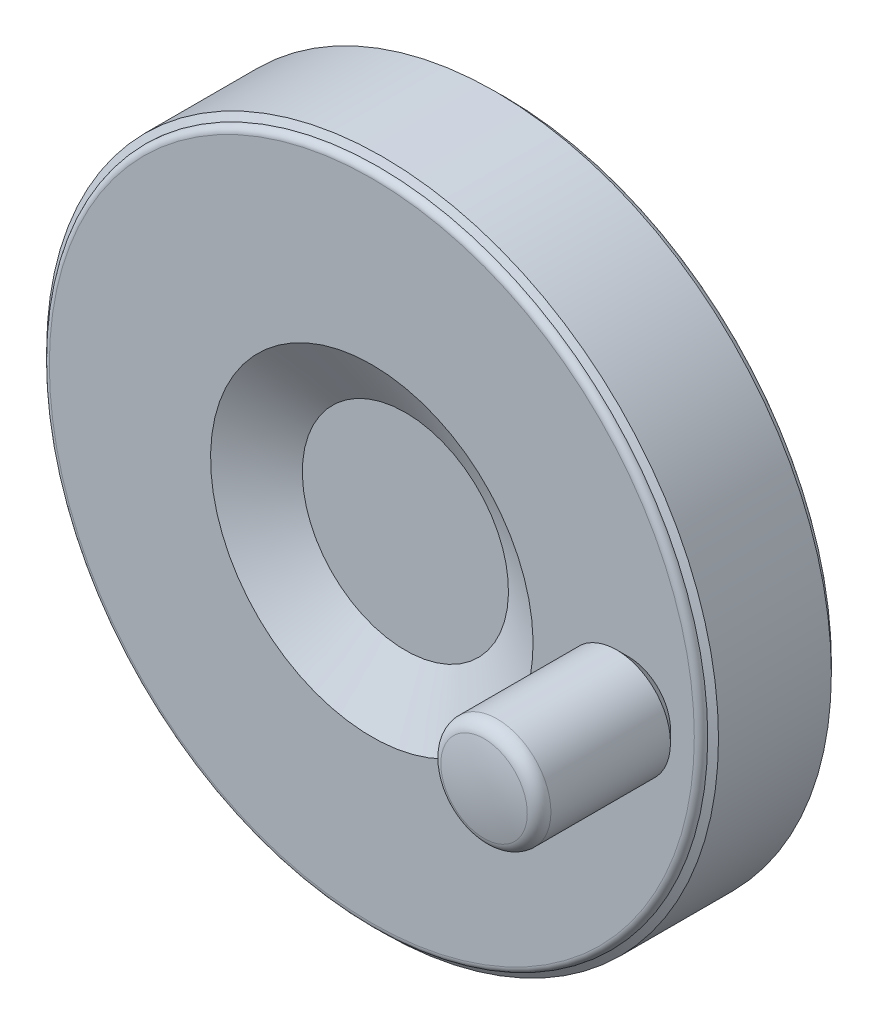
ISO-10303-21;
HEADER;
FILE_DESCRIPTION(('STEP AP214'),'2;1');
FILE_NAME('part.step','',(''),(''),'','','');
FILE_SCHEMA(('AUTOMOTIVE_DESIGN { 1 0 10303 214 1 1 1 1 }'));
ENDSEC;
DATA;
#1=APPLICATION_CONTEXT('core data for automotive mechanical design processes');
#2=APPLICATION_PROTOCOL_DEFINITION('international standard','automotive_design',2000,#1);
#3=PRODUCT_CONTEXT('',#1,'mechanical');
#4=PRODUCT('Part','Part','',(#3));
#5=PRODUCT_RELATED_PRODUCT_CATEGORY('part','',(#4));
#6=PRODUCT_DEFINITION_FORMATION('','',#4);
#7=PRODUCT_DEFINITION_CONTEXT('part definition',#1,'design');
#8=PRODUCT_DEFINITION('design','',#6,#7);
#9=PRODUCT_DEFINITION_SHAPE('','',#8);
#10=(LENGTH_UNIT() NAMED_UNIT(*) SI_UNIT(.MILLI.,.METRE.));
#11=(NAMED_UNIT(*) PLANE_ANGLE_UNIT() SI_UNIT($,.RADIAN.));
#12=(NAMED_UNIT(*) SI_UNIT($,.STERADIAN.) SOLID_ANGLE_UNIT());
#13=UNCERTAINTY_MEASURE_WITH_UNIT(LENGTH_MEASURE(1.E-05),#10,'distance_accuracy_value','');
#14=(GEOMETRIC_REPRESENTATION_CONTEXT(3) GLOBAL_UNCERTAINTY_ASSIGNED_CONTEXT((#13)) GLOBAL_UNIT_ASSIGNED_CONTEXT((#10,
#11,#12)) REPRESENTATION_CONTEXT('',''));
#15=CARTESIAN_POINT('',(0.,0.,0.));
#16=DIRECTION('',(0.,0.,1.));
#17=DIRECTION('',(1.,0.,0.));
#18=AXIS2_PLACEMENT_3D('',#15,#16,#17);
#19=CARTESIAN_POINT('',(-17.5,0.,7.44337567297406));
#20=DIRECTION('',(0.,0.5,0.866025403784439));
#21=DIRECTION('',(0.,0.866025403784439,-0.5));
#22=AXIS2_PLACEMENT_3D('',#19,#20,#21);
#23=PLANE('',#22);
#24=DIRECTION('',(-1.,0.,0.));
#25=VECTOR('',#24,1.);
#26=CARTESIAN_POINT('',(-17.5,0.,7.44337567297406));
#27=LINE('',#26,#25);
#28=CARTESIAN_POINT('',(-13.3333333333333,0.,7.44337567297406));
#29=VERTEX_POINT('',#28);
#30=CARTESIAN_POINT('',(-17.5,0.,7.44337567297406));
#31=VERTEX_POINT('',#30);
#32=EDGE_CURVE('E97',#29,#31,#27,.T.);
#33=ORIENTED_EDGE('',*,*,#32,.T.);
#34=DIRECTION('',(0.,0.866025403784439,-0.5));
#35=VECTOR('',#34,1.);
#36=CARTESIAN_POINT('',(-17.5,0.,7.44337567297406));
#37=LINE('',#36,#35);
#38=CARTESIAN_POINT('',(-17.5,1.25,6.72168783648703));
#39=VERTEX_POINT('',#38);
#40=EDGE_CURVE('E86',#39,#31,#37,.F.);
#41=ORIENTED_EDGE('',*,*,#40,.F.);
#42=DIRECTION('',(-1.,0.,0.));
#43=VECTOR('',#42,1.);
#44=CARTESIAN_POINT('',(-17.5,1.25,6.72168783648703));
#45=LINE('',#44,#43);
#46=CARTESIAN_POINT('',(-13.3333333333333,1.25,6.72168783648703));
#47=VERTEX_POINT('',#46);
#48=EDGE_CURVE('E299',#39,#47,#45,.F.);
#49=ORIENTED_EDGE('',*,*,#48,.T.);
#50=DIRECTION('',(0.,0.866025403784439,-0.5));
#51=VECTOR('',#50,1.);
#52=CARTESIAN_POINT('',(-13.3333333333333,0.,7.44337567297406));
#53=LINE('',#52,#51);
#54=EDGE_CURVE('E81',#29,#47,#53,.T.);
#55=ORIENTED_EDGE('',*,*,#54,.F.);
#56=EDGE_LOOP('',(#33,#41,#49,#55));
#57=FACE_BOUND('',#56,.T.);
#58=ADVANCED_FACE('F14',(#57),#23,.F.);
#59=CARTESIAN_POINT('',(-17.5,-1.25,6.72168783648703));
#60=DIRECTION('',(0.,-0.5,0.866025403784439));
#61=DIRECTION('',(0.,0.866025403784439,0.5));
#62=AXIS2_PLACEMENT_3D('',#59,#60,#61);
#63=PLANE('',#62);
#64=DIRECTION('',(1.,0.,0.));
#65=VECTOR('',#64,1.);
#66=CARTESIAN_POINT('',(-17.5,-1.25,6.72168783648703));
#67=LINE('',#66,#65);
#68=CARTESIAN_POINT('',(-13.3333333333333,-1.25,6.72168783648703));
#69=VERTEX_POINT('',#68);
#70=CARTESIAN_POINT('',(-17.5,-1.25,6.72168783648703));
#71=VERTEX_POINT('',#70);
#72=EDGE_CURVE('E102',#69,#71,#67,.F.);
#73=ORIENTED_EDGE('',*,*,#72,.T.);
#74=DIRECTION('',(0.,0.866025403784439,0.5));
#75=VECTOR('',#74,1.);
#76=CARTESIAN_POINT('',(-17.5,-1.25,6.72168783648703));
#77=LINE('',#76,#75);
#78=EDGE_CURVE('E89',#31,#71,#77,.F.);
#79=ORIENTED_EDGE('',*,*,#78,.F.);
#80=ORIENTED_EDGE('',*,*,#32,.F.);
#81=DIRECTION('',(0.,0.866025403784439,0.5));
#82=VECTOR('',#81,1.);
#83=CARTESIAN_POINT('',(-13.3333333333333,-1.25,6.72168783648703));
#84=LINE('',#83,#82);
#85=EDGE_CURVE('E104',#69,#29,#84,.T.);
#86=ORIENTED_EDGE('',*,*,#85,.F.);
#87=EDGE_LOOP('',(#73,#79,#80,#86));
#88=FACE_BOUND('',#87,.T.);
#89=ADVANCED_FACE('F100',(#88),#63,.F.);
#90=CARTESIAN_POINT('',(-17.5,1.25,6.72168783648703));
#91=DIRECTION('',(0.,1.,0.));
#92=DIRECTION('',(-1.,0.,0.));
#93=AXIS2_PLACEMENT_3D('',#90,#91,#92);
#94=PLANE('',#93);
#95=ORIENTED_EDGE('',*,*,#48,.F.);
#96=DIRECTION('',(0.,0.,1.));
#97=VECTOR('',#96,1.);
#98=CARTESIAN_POINT('',(-17.5,1.25,6.72168783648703));
#99=LINE('',#98,#97);
#100=CARTESIAN_POINT('',(-17.5,1.25,5.27831216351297));
#101=VERTEX_POINT('',#100);
#102=EDGE_CURVE('E92',#101,#39,#99,.T.);
#103=ORIENTED_EDGE('',*,*,#102,.F.);
#104=DIRECTION('',(-1.,0.,0.));
#105=VECTOR('',#104,1.);
#106=CARTESIAN_POINT('',(-17.5,1.25,5.27831216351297));
#107=LINE('',#106,#105);
#108=CARTESIAN_POINT('',(-13.3333333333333,1.25,5.27831216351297));
#109=VERTEX_POINT('',#108);
#110=EDGE_CURVE('E289',#101,#109,#107,.F.);
#111=ORIENTED_EDGE('',*,*,#110,.T.);
#112=DIRECTION('',(0.,0.,1.));
#113=VECTOR('',#112,1.);
#114=CARTESIAN_POINT('',(-13.3333333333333,1.25,6.72168783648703));
#115=LINE('',#114,#113);
#116=EDGE_CURVE('E297',#47,#109,#115,.F.);
#117=ORIENTED_EDGE('',*,*,#116,.F.);
#118=EDGE_LOOP('',(#95,#103,#111,#117));
#119=FACE_BOUND('',#118,.T.);
#120=ADVANCED_FACE('F302',(#119),#94,.F.);
#121=CARTESIAN_POINT('',(-17.5,-1.25,5.27831216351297));
#122=DIRECTION('',(0.,-1.,0.));
#123=DIRECTION('',(1.,0.,0.));
#124=AXIS2_PLACEMENT_3D('',#121,#122,#123);
#125=PLANE('',#124);
#126=DIRECTION('',(-1.,0.,0.));
#127=VECTOR('',#126,1.);
#128=CARTESIAN_POINT('',(-17.5,-1.25,5.27831216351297));
#129=LINE('',#128,#127);
#130=CARTESIAN_POINT('',(-13.3333333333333,-1.25,5.27831216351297));
#131=VERTEX_POINT('',#130);
#132=CARTESIAN_POINT('',(-17.5,-1.25,5.27831216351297));
#133=VERTEX_POINT('',#132);
#134=EDGE_CURVE('E280',#131,#133,#129,.T.);
#135=ORIENTED_EDGE('',*,*,#134,.T.);
#136=DIRECTION('',(0.,0.,1.));
#137=VECTOR('',#136,1.);
#138=CARTESIAN_POINT('',(-17.5,-1.25,5.27831216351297));
#139=LINE('',#138,#137);
#140=EDGE_CURVE('E294',#71,#133,#139,.F.);
#141=ORIENTED_EDGE('',*,*,#140,.F.);
#142=ORIENTED_EDGE('',*,*,#72,.F.);
#143=DIRECTION('',(0.,0.,1.));
#144=VECTOR('',#143,1.);
#145=CARTESIAN_POINT('',(-13.3333333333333,-1.25,0.));
#146=LINE('',#145,#144);
#147=EDGE_CURVE('E283',#131,#69,#146,.T.);
#148=ORIENTED_EDGE('',*,*,#147,.F.);
#149=EDGE_LOOP('',(#135,#141,#142,#148));
#150=FACE_BOUND('',#149,.T.);
#151=ADVANCED_FACE('F309',(#150),#125,.F.);
#152=CARTESIAN_POINT('',(-17.5,1.25,5.27831216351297));
#153=DIRECTION('',(0.,0.5,-0.866025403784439));
#154=DIRECTION('',(0.,-0.866025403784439,-0.5));
#155=AXIS2_PLACEMENT_3D('',#152,#153,#154);
#156=PLANE('',#155);
#157=ORIENTED_EDGE('',*,*,#110,.F.);
#158=DIRECTION('',(0.,-0.866025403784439,-0.5));
#159=VECTOR('',#158,1.);
#160=CARTESIAN_POINT('',(-17.5,1.25,5.27831216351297));
#161=LINE('',#160,#159);
#162=CARTESIAN_POINT('',(-17.5,0.,4.55662432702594));
#163=VERTEX_POINT('',#162);
#164=EDGE_CURVE('E292',#163,#101,#161,.F.);
#165=ORIENTED_EDGE('',*,*,#164,.F.);
#166=DIRECTION('',(-1.,0.,0.));
#167=VECTOR('',#166,1.);
#168=CARTESIAN_POINT('',(-17.5,0.,4.55662432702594));
#169=LINE('',#168,#167);
#170=CARTESIAN_POINT('',(-13.3333333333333,0.,4.55662432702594));
#171=VERTEX_POINT('',#170);
#172=EDGE_CURVE('E278',#163,#171,#169,.F.);
#173=ORIENTED_EDGE('',*,*,#172,.T.);
#174=DIRECTION('',(0.,-0.866025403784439,-0.5));
#175=VECTOR('',#174,1.);
#176=CARTESIAN_POINT('',(-13.3333333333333,1.25,5.27831216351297));
#177=LINE('',#176,#175);
#178=EDGE_CURVE('E286',#109,#171,#177,.T.);
#179=ORIENTED_EDGE('',*,*,#178,.F.);
#180=EDGE_LOOP('',(#157,#165,#173,#179));
#181=FACE_BOUND('',#180,.T.);
#182=ADVANCED_FACE('F316',(#181),#156,.F.);
#183=CARTESIAN_POINT('',(-13.3333333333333,0.,0.));
#184=DIRECTION('',(-1.,0.,0.));
#185=DIRECTION('',(0.,-1.,0.));
#186=AXIS2_PLACEMENT_3D('',#183,#184,#185);
#187=PLANE('',#186);
#188=ORIENTED_EDGE('',*,*,#54,.T.);
#189=ORIENTED_EDGE('',*,*,#116,.T.);
#190=ORIENTED_EDGE('',*,*,#178,.T.);
#191=DIRECTION('',(0.,-0.866025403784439,0.5));
#192=VECTOR('',#191,1.);
#193=CARTESIAN_POINT('',(-13.3333333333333,0.,4.55662432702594));
#194=LINE('',#193,#192);
#195=EDGE_CURVE('E275',#171,#131,#194,.T.);
#196=ORIENTED_EDGE('',*,*,#195,.T.);
#197=ORIENTED_EDGE('',*,*,#147,.T.);
#198=ORIENTED_EDGE('',*,*,#85,.T.);
#199=EDGE_LOOP('',(#188,#189,#190,#196,#197,#198));
#200=FACE_BOUND('',#199,.T.);
#201=ADVANCED_FACE('F306',(#200),#187,.T.);
#202=CARTESIAN_POINT('',(-17.5,0.,4.55662432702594));
#203=DIRECTION('',(0.,-0.5,-0.866025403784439));
#204=DIRECTION('',(0.,-0.866025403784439,0.5));
#205=AXIS2_PLACEMENT_3D('',#202,#203,#204);
#206=PLANE('',#205);
#207=ORIENTED_EDGE('',*,*,#172,.F.);
#208=DIRECTION('',(0.,0.866025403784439,-0.5));
#209=VECTOR('',#208,1.);
#210=CARTESIAN_POINT('',(-17.5,-1.25,5.27831216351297));
#211=LINE('',#210,#209);
#212=EDGE_CURVE('E271',#133,#163,#211,.T.);
#213=ORIENTED_EDGE('',*,*,#212,.F.);
#214=ORIENTED_EDGE('',*,*,#134,.F.);
#215=ORIENTED_EDGE('',*,*,#195,.F.);
#216=EDGE_LOOP('',(#207,#213,#214,#215));
#217=FACE_BOUND('',#216,.T.);
#218=ADVANCED_FACE('F314',(#217),#206,.F.);
#219=CARTESIAN_POINT('',(-17.5,0.,7.00475));
#220=DIRECTION('',(-1.,0.,0.));
#221=DIRECTION('',(0.,-1.,0.));
#222=AXIS2_PLACEMENT_3D('',#219,#220,#221);
#223=PLANE('',#222);
#224=CARTESIAN_POINT('',(-17.4999999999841,0.,6.));
#225=DIRECTION('',(1.,0.,0.));
#226=DIRECTION('',(0.,1.,0.));
#227=AXIS2_PLACEMENT_3D('',#224,#225,#226);
#228=CIRCLE('',#227,2.00950000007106);
#229=CARTESIAN_POINT('',(-17.4999999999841,2.00950000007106,6.));
#230=VERTEX_POINT('',#229);
#231=EDGE_CURVE('E274',#230,#230,#228,.T.);
#232=ORIENTED_EDGE('',*,*,#231,.F.);
#233=EDGE_LOOP('',(#232));
#234=FACE_BOUND('',#233,.T.);
#235=ORIENTED_EDGE('',*,*,#140,.T.);
#236=ORIENTED_EDGE('',*,*,#212,.T.);
#237=ORIENTED_EDGE('',*,*,#164,.T.);
#238=ORIENTED_EDGE('',*,*,#102,.T.);
#239=ORIENTED_EDGE('',*,*,#40,.T.);
#240=ORIENTED_EDGE('',*,*,#78,.T.);
#241=EDGE_LOOP('',(#235,#236,#237,#238,#239,#240));
#242=FACE_BOUND('',#241,.T.);
#243=ADVANCED_FACE('F87',(#234,#242),#223,.T.);
#244=CARTESIAN_POINT('',(0.,0.,11.5));
#245=DIRECTION('',(0.,0.,-1.));
#246=DIRECTION('',(-1.,0.,0.));
#247=AXIS2_PLACEMENT_3D('',#244,#245,#246);
#248=CYLINDRICAL_SURFACE('',#247,5.);
#249=CARTESIAN_POINT('',(0.,0.,22.));
#250=DIRECTION('',(0.,0.,-1.));
#251=DIRECTION('',(0.,-1.,0.));
#252=AXIS2_PLACEMENT_3D('',#249,#250,#251);
#253=CIRCLE('',#252,5.);
#254=CARTESIAN_POINT('',(0.,-5.,22.));
#255=VERTEX_POINT('',#254);
#256=EDGE_CURVE('E94',#255,#255,#253,.T.);
#257=ORIENTED_EDGE('',*,*,#256,.F.);
#258=EDGE_LOOP('',(#257));
#259=FACE_BOUND('',#258,.T.);
#260=CARTESIAN_POINT('',(0.,0.,0.));
#261=DIRECTION('',(0.,0.,-1.));
#262=DIRECTION('',(-1.,0.,0.));
#263=AXIS2_PLACEMENT_3D('',#260,#261,#262);
#264=CIRCLE('',#263,5.);
#265=CARTESIAN_POINT('',(-5.,0.,0.));
#266=VERTEX_POINT('',#265);
#267=EDGE_CURVE('E270',#266,#266,#264,.F.);
#268=ORIENTED_EDGE('',*,*,#267,.F.);
#269=EDGE_LOOP('',(#268));
#270=FACE_BOUND('',#269,.T.);
#271=ADVANCED_FACE('F383',(#259,#270),#248,.F.);
#272=CARTESIAN_POINT('',(-17.0095000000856,0.,6.));
#273=DIRECTION('',(1.,0.,0.));
#274=DIRECTION('',(0.,1.,0.));
#275=AXIS2_PLACEMENT_3D('',#272,#273,#274);
#276=CONICAL_SURFACE('',#275,2.49999999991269,0.785398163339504);
#277=CARTESIAN_POINT('',(-17.0095,0.,6.));
#278=DIRECTION('',(-1.,0.,0.));
#279=DIRECTION('',(0.,-1.,0.));
#280=AXIS2_PLACEMENT_3D('',#277,#278,#279);
#281=CIRCLE('',#280,2.5);
#282=CARTESIAN_POINT('',(-17.0095,-2.5,6.));
#283=VERTEX_POINT('',#282);
#284=EDGE_CURVE('E267',#283,#283,#281,.F.);
#285=ORIENTED_EDGE('',*,*,#284,.F.);
#286=EDGE_LOOP('',(#285));
#287=FACE_BOUND('',#286,.T.);
#288=ORIENTED_EDGE('',*,*,#231,.T.);
#289=EDGE_LOOP('',(#288));
#290=FACE_BOUND('',#289,.T.);
#291=ADVANCED_FACE('F393',(#287,#290),#276,.T.);
#292=CARTESIAN_POINT('',(-6.5,0.,0.));
#293=DIRECTION('',(0.,0.,-1.));
#294=DIRECTION('',(-1.,0.,0.));
#295=AXIS2_PLACEMENT_3D('',#292,#293,#294);
#296=PLANE('',#295);
#297=ORIENTED_EDGE('',*,*,#267,.T.);
#298=EDGE_LOOP('',(#297));
#299=FACE_BOUND('',#298,.T.);
#300=CARTESIAN_POINT('',(0.,0.,0.));
#301=DIRECTION('',(0.,0.,-1.));
#302=DIRECTION('',(-1.,0.,0.));
#303=AXIS2_PLACEMENT_3D('',#300,#301,#302);
#304=CIRCLE('',#303,8.);
#305=CARTESIAN_POINT('',(-8.,0.,0.));
#306=VERTEX_POINT('',#305);
#307=EDGE_CURVE('E266',#306,#306,#304,.F.);
#308=ORIENTED_EDGE('',*,*,#307,.F.);
#309=EDGE_LOOP('',(#308));
#310=FACE_BOUND('',#309,.T.);
#311=ADVANCED_FACE('F403',(#299,#310),#296,.T.);
#312=CARTESIAN_POINT('',(-11.25,0.,6.));
#313=DIRECTION('',(-1.,0.,0.));
#314=DIRECTION('',(0.,-1.,0.));
#315=AXIS2_PLACEMENT_3D('',#312,#313,#314);
#316=CYLINDRICAL_SURFACE('',#315,2.5);
#317=CARTESIAN_POINT('',(-7.99999999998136,0.,6.));
#318=DIRECTION('',(-1.,0.,0.));
#319=DIRECTION('',(0.,0.,1.));
#320=AXIS2_PLACEMENT_3D('',#317,#318,#319);
#321=CIRCLE('',#320,2.49999999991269);
#322=CARTESIAN_POINT('',(-7.99999999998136,0.,8.49999999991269));
#323=VERTEX_POINT('',#322);
#324=EDGE_CURVE('E263',#323,#323,#321,.T.);
#325=ORIENTED_EDGE('',*,*,#324,.T.);
#326=EDGE_LOOP('',(#325));
#327=FACE_BOUND('',#326,.T.);
#328=ORIENTED_EDGE('',*,*,#284,.T.);
#329=EDGE_LOOP('',(#328));
#330=FACE_BOUND('',#329,.T.);
#331=ADVANCED_FACE('F413',(#327,#330),#316,.T.);
#332=CARTESIAN_POINT('',(0.,0.,0.15));
#333=DIRECTION('',(0.,0.,-1.));
#334=DIRECTION('',(-1.,0.,0.));
#335=AXIS2_PLACEMENT_3D('',#332,#333,#334);
#336=CYLINDRICAL_SURFACE('',#335,8.);
#337=CARTESIAN_POINT('',(0.,0.,0.3));
#338=DIRECTION('',(0.,0.,-1.));
#339=DIRECTION('',(-1.,0.,0.));
#340=AXIS2_PLACEMENT_3D('',#337,#338,#339);
#341=CIRCLE('',#340,8.);
#342=CARTESIAN_POINT('',(-8.,0.,0.3));
#343=VERTEX_POINT('',#342);
#344=EDGE_CURVE('E262',#343,#343,#341,.F.);
#345=ORIENTED_EDGE('',*,*,#344,.F.);
#346=EDGE_LOOP('',(#345));
#347=FACE_BOUND('',#346,.T.);
#348=ORIENTED_EDGE('',*,*,#307,.T.);
#349=EDGE_LOOP('',(#348));
#350=FACE_BOUND('',#349,.T.);
#351=ADVANCED_FACE('F423',(#347,#350),#336,.T.);
#352=CARTESIAN_POINT('',(-8.27777777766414,0.,6.));
#353=DIRECTION('',(-1.,0.,0.));
#354=DIRECTION('',(0.,-1.,0.));
#355=AXIS2_PLACEMENT_3D('',#352,#353,#354);
#356=CONICAL_SURFACE('',#355,2.77777777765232,0.785398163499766);
#357=CARTESIAN_POINT('',(-8.27777777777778,0.,6.));
#358=DIRECTION('',(-1.,0.,0.));
#359=DIRECTION('',(0.,-1.,0.));
#360=AXIS2_PLACEMENT_3D('',#357,#358,#359);
#361=CIRCLE('',#360,2.77777777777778);
#362=CARTESIAN_POINT('',(-8.27777777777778,-2.77777777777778,6.));
#363=VERTEX_POINT('',#362);
#364=EDGE_CURVE('E259',#363,#363,#361,.T.);
#365=ORIENTED_EDGE('',*,*,#364,.T.);
#366=EDGE_LOOP('',(#365));
#367=FACE_BOUND('',#366,.T.);
#368=ORIENTED_EDGE('',*,*,#324,.F.);
#369=EDGE_LOOP('',(#368));
#370=FACE_BOUND('',#369,.T.);
#371=ADVANCED_FACE('F433',(#367,#370),#356,.F.);
#372=CARTESIAN_POINT('',(-12.,0.,0.3));
#373=DIRECTION('',(0.,0.,-1.));
#374=DIRECTION('',(-1.,0.,0.));
#375=AXIS2_PLACEMENT_3D('',#372,#373,#374);
#376=PLANE('',#375);
#377=ORIENTED_EDGE('',*,*,#344,.T.);
#378=EDGE_LOOP('',(#377));
#379=FACE_BOUND('',#378,.T.);
#380=CARTESIAN_POINT('',(0.,0.,0.3));
#381=DIRECTION('',(0.,0.,1.));
#382=DIRECTION('',(1.,0.,0.));
#383=AXIS2_PLACEMENT_3D('',#380,#381,#382);
#384=CIRCLE('',#383,16.);
#385=CARTESIAN_POINT('',(16.,0.,0.3));
#386=VERTEX_POINT('',#385);
#387=EDGE_CURVE('E155',#386,#386,#384,.T.);
#388=ORIENTED_EDGE('',*,*,#387,.F.);
#389=EDGE_LOOP('',(#388));
#390=FACE_BOUND('',#389,.T.);
#391=ADVANCED_FACE('F175',(#379,#390),#376,.T.);
#392=CARTESIAN_POINT('',(-12.8888888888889,0.,6.));
#393=DIRECTION('',(-1.,0.,0.));
#394=DIRECTION('',(0.,-1.,0.));
#395=AXIS2_PLACEMENT_3D('',#392,#393,#394);
#396=CYLINDRICAL_SURFACE('',#395,2.77777777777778);
#397=CARTESIAN_POINT('',(-17.5,0.,3.22222222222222));
#398=CARTESIAN_POINT('',(-17.4999972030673,0.15483515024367,3.22222928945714));
#399=CARTESIAN_POINT('',(-17.4979218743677,0.309868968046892,3.23522278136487));
#400=CARTESIAN_POINT('',(-17.4898374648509,0.61571019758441,3.2868669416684));
#401=CARTESIAN_POINT('',(-17.4838203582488,0.766508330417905,3.32556995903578));
#402=CARTESIAN_POINT('',(-17.4685279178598,1.05923809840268,3.42744542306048));
#403=CARTESIAN_POINT('',(-17.4592565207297,1.2011802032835,3.49058831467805));
#404=CARTESIAN_POINT('',(-17.4384797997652,1.47239412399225,3.63948377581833));
#405=CARTESIAN_POINT('',(-17.4269753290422,1.6016707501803,3.72522771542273));
#406=CARTESIAN_POINT('',(-17.4028946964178,1.84508936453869,3.91770404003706));
#407=CARTESIAN_POINT('',(-17.3903107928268,1.95910384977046,4.02459673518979));
#408=CARTESIAN_POINT('',(-17.3655490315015,2.16766339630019,4.2559961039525));
#409=CARTESIAN_POINT('',(-17.3533712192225,2.26220628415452,4.38050474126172));
#410=CARTESIAN_POINT('',(-17.3307273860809,2.42962752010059,4.64445008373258));
#411=CARTESIAN_POINT('',(-17.3202712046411,2.5023831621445,4.78396553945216));
#412=CARTESIAN_POINT('',(-17.3023595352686,2.62337928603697,5.07342930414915));
#413=CARTESIAN_POINT('',(-17.2949038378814,2.67162147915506,5.22337688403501));
#414=CARTESIAN_POINT('',(-17.2839127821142,2.74182853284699,5.52812072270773));
#415=CARTESIAN_POINT('',(-17.2803451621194,2.76400975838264,5.68286594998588));
#416=CARTESIAN_POINT('',(-17.2774364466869,2.78213578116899,5.99392021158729));
#417=CARTESIAN_POINT('',(-17.2780950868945,2.77808221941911,6.15022914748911));
#418=CARTESIAN_POINT('',(-17.2835349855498,2.74403032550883,6.45843547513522));
#419=CARTESIAN_POINT('',(-17.2882777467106,2.71427425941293,6.61036041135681));
#420=CARTESIAN_POINT('',(-17.3012913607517,2.63004131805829,6.90703490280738));
#421=CARTESIAN_POINT('',(-17.3095623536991,2.57556346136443,7.05178417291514));
#422=CARTESIAN_POINT('',(-17.3287428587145,2.44318258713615,7.33073258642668));
#423=CARTESIAN_POINT('',(-17.3396638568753,2.36517722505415,7.46488233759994));
#424=CARTESIAN_POINT('',(-17.3629046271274,2.18803489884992,7.71826969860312));
#425=CARTESIAN_POINT('',(-17.3752243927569,2.0888980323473,7.83750737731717));
#426=CARTESIAN_POINT('',(-17.4000426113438,1.8710016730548,8.05908020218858));
#427=CARTESIAN_POINT('',(-17.4125415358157,1.75203769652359,8.16121428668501));
#428=CARTESIAN_POINT('',(-17.4361897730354,1.49848935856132,8.34414600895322));
#429=CARTESIAN_POINT('',(-17.447338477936,1.36389801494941,8.42493405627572));
#430=CARTESIAN_POINT('',(-17.4670449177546,1.08269801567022,8.56288766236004));
#431=CARTESIAN_POINT('',(-17.4755986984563,0.936071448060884,8.62001721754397));
#432=CARTESIAN_POINT('',(-17.4891076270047,0.635333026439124,8.70866796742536));
#433=CARTESIAN_POINT('',(-17.4940703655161,0.481237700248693,8.74024319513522));
#434=CARTESIAN_POINT('',(-17.4979751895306,0.271699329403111,8.76499642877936));
#435=CARTESIAN_POINT('',(-17.4987328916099,0.21747979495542,8.76978562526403));
#436=CARTESIAN_POINT('',(-17.4997457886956,0.108848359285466,8.776177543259));
#437=CARTESIAN_POINT('',(-17.5000009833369,0.0544364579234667,8.77778026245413));
#438=CARTESIAN_POINT('',(-17.4999972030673,-0.154835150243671,8.77777071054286));
#439=CARTESIAN_POINT('',(-17.4979218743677,-0.309868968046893,8.76477721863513));
#440=CARTESIAN_POINT('',(-17.4898374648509,-0.615710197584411,8.7131330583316));
#441=CARTESIAN_POINT('',(-17.4838203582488,-0.766508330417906,8.67443004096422));
#442=CARTESIAN_POINT('',(-17.4685279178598,-1.05923809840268,8.57255457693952));
#443=CARTESIAN_POINT('',(-17.4592565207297,-1.20118020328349,8.50941168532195));
#444=CARTESIAN_POINT('',(-17.4384797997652,-1.47239412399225,8.36051622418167));
#445=CARTESIAN_POINT('',(-17.4269753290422,-1.6016707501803,8.27477228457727));
#446=CARTESIAN_POINT('',(-17.4028946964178,-1.84508936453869,8.08229595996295));
#447=CARTESIAN_POINT('',(-17.3903107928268,-1.95910384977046,7.97540326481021));
#448=CARTESIAN_POINT('',(-17.3655490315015,-2.16766339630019,7.7440038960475));
#449=CARTESIAN_POINT('',(-17.3533712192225,-2.26220628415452,7.61949525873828));
#450=CARTESIAN_POINT('',(-17.3307273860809,-2.42962752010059,7.35554991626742));
#451=CARTESIAN_POINT('',(-17.3202712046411,-2.5023831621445,7.21603446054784));
#452=CARTESIAN_POINT('',(-17.3023595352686,-2.62337928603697,6.92657069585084));
#453=CARTESIAN_POINT('',(-17.2949038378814,-2.67162147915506,6.77662311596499));
#454=CARTESIAN_POINT('',(-17.2839127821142,-2.74182853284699,6.47187927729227));
#455=CARTESIAN_POINT('',(-17.2803451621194,-2.76400975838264,6.31713405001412));
#456=CARTESIAN_POINT('',(-17.2774364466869,-2.78213578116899,6.00607978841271));
#457=CARTESIAN_POINT('',(-17.2780950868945,-2.77808221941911,5.84977085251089));
#458=CARTESIAN_POINT('',(-17.2835349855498,-2.74403032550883,5.54156452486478));
#459=CARTESIAN_POINT('',(-17.2882777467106,-2.71427425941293,5.38963958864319));
#460=CARTESIAN_POINT('',(-17.3012913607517,-2.63004131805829,5.09296509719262));
#461=CARTESIAN_POINT('',(-17.3095623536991,-2.57556346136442,4.94821582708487));
#462=CARTESIAN_POINT('',(-17.3287428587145,-2.44318258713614,4.66926741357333));
#463=CARTESIAN_POINT('',(-17.3396638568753,-2.36517722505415,4.53511766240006));
#464=CARTESIAN_POINT('',(-17.3629046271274,-2.18803489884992,4.28173030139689));
#465=CARTESIAN_POINT('',(-17.3752243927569,-2.0888980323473,4.16249262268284));
#466=CARTESIAN_POINT('',(-17.4000426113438,-1.8710016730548,3.94091979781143));
#467=CARTESIAN_POINT('',(-17.4125415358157,-1.75203769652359,3.83878571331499));
#468=CARTESIAN_POINT('',(-17.4361897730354,-1.49848935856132,3.65585399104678));
#469=CARTESIAN_POINT('',(-17.447338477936,-1.36389801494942,3.57506594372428));
#470=CARTESIAN_POINT('',(-17.4670449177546,-1.08269801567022,3.43711233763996));
#471=CARTESIAN_POINT('',(-17.4755986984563,-0.936071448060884,3.37998278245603));
#472=CARTESIAN_POINT('',(-17.4891076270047,-0.635333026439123,3.29133203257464));
#473=CARTESIAN_POINT('',(-17.4940703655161,-0.481237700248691,3.25975680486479));
#474=CARTESIAN_POINT('',(-17.4979751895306,-0.27169932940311,3.23500357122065));
#475=CARTESIAN_POINT('',(-17.4987328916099,-0.217479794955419,3.23021437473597));
#476=CARTESIAN_POINT('',(-17.4997457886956,-0.108848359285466,3.223822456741));
#477=CARTESIAN_POINT('',(-17.5000009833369,-0.0544364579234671,3.22221973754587));
#478=CARTESIAN_POINT('',(-17.5,0.,3.22222222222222));
#479=B_SPLINE_CURVE_WITH_KNOTS('',3,(#397,#398,#399,#400,#401,#402,#403,#404,#405,#406,#407,
#408,#409,#410,#411,#412,#413,#414,#415,#416,#417,#418,#419,#420,#421,#422,#423,#424,#425,#426,
#427,#428,#429,#430,#431,#432,#433,#434,#435,#436,#437,#438,#439,#440,#441,#442,#443,#444,#445,
#446,#447,#448,#449,#450,#451,#452,#453,#454,#455,#456,#457,#458,#459,#460,#461,#462,#463,#464,
#465,#466,#467,#468,#469,#470,#471,#472,#473,#474,#475,#476,#477,#478),.UNSPECIFIED.,.T.,.F.,(4,
2,2,2,2,2,2,2,2,2,2,2,2,2,2,2,2,2,2,2,2,2,2,2,2,2,2,2,2,2,2,2,2,2,2,2,2,2,2,2,4),(0.,
0.464297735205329,0.929543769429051,1.3942289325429,1.85873691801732,2.32691103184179,
2.79513737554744,3.26595321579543,3.73673618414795,4.20358233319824,4.6703992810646,
5.13286354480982,5.5953461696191,6.05987033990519,6.52439236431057,6.99404092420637,
7.46390013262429,7.93447176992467,8.40404579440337,8.56728202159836,8.73051836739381,
9.19481610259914,9.66006213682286,10.1247472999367,10.5892552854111,11.0574293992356,
11.5256557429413,11.9964715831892,12.4672545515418,12.9341007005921,13.4009176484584,
13.8633819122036,14.3258645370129,14.790388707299,15.2549107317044,15.7245592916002,
16.1944185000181,16.6649901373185,17.1345641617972,17.2978003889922,17.4610367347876),.UNSPECIFIED.);
#480=CARTESIAN_POINT('',(-17.5,0.,3.22222222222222));
#481=VERTEX_POINT('',#480);
#482=EDGE_CURVE('E146',#481,#481,#479,.T.);
#483=ORIENTED_EDGE('',*,*,#482,.F.);
#484=EDGE_LOOP('',(#483));
#485=FACE_BOUND('',#484,.T.);
#486=ORIENTED_EDGE('',*,*,#364,.F.);
#487=EDGE_LOOP('',(#486));
#488=FACE_BOUND('',#487,.T.);
#489=ADVANCED_FACE('F157',(#485,#488),#396,.F.);
#490=CARTESIAN_POINT('',(0.,0.,1.8));
#491=DIRECTION('',(0.,0.,1.));
#492=DIRECTION('',(1.,0.,0.));
#493=AXIS2_PLACEMENT_3D('',#490,#491,#492);
#494=CONICAL_SURFACE('',#493,17.5,0.785398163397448);
#495=CARTESIAN_POINT('',(0.,0.,1.8));
#496=DIRECTION('',(0.,0.,-1.));
#497=DIRECTION('',(-1.,0.,0.));
#498=AXIS2_PLACEMENT_3D('',#495,#496,#497);
#499=CIRCLE('',#498,17.5);
#500=CARTESIAN_POINT('',(-17.5,0.,1.8));
#501=VERTEX_POINT('',#500);
#502=EDGE_CURVE('E154',#501,#501,#499,.F.);
#503=ORIENTED_EDGE('',*,*,#502,.F.);
#504=EDGE_LOOP('',(#503));
#505=FACE_BOUND('',#504,.T.);
#506=ORIENTED_EDGE('',*,*,#387,.T.);
#507=EDGE_LOOP('',(#506));
#508=FACE_BOUND('',#507,.T.);
#509=ADVANCED_FACE('F166',(#505,#508),#494,.T.);
#510=CARTESIAN_POINT('',(0.,0.,13.4));
#511=DIRECTION('',(0.,0.,-1.));
#512=DIRECTION('',(-1.,0.,0.));
#513=AXIS2_PLACEMENT_3D('',#510,#511,#512);
#514=CYLINDRICAL_SURFACE('',#513,17.5);
#515=ORIENTED_EDGE('',*,*,#482,.T.);
#516=EDGE_LOOP('',(#515));
#517=FACE_BOUND('',#516,.T.);
#518=CARTESIAN_POINT('',(0.,0.,25.));
#519=DIRECTION('',(0.,0.,1.));
#520=DIRECTION('',(-1.,0.,0.));
#521=AXIS2_PLACEMENT_3D('',#518,#519,#520);
#522=CIRCLE('',#521,17.5);
#523=CARTESIAN_POINT('',(-17.5,0.,25.));
#524=VERTEX_POINT('',#523);
#525=EDGE_CURVE('E145',#524,#524,#522,.T.);
#526=ORIENTED_EDGE('',*,*,#525,.F.);
#527=EDGE_LOOP('',(#526));
#528=FACE_BOUND('',#527,.T.);
#529=ORIENTED_EDGE('',*,*,#502,.T.);
#530=EDGE_LOOP('',(#529));
#531=FACE_BOUND('',#530,.T.);
#532=ADVANCED_FACE('F161',(#517,#528,#531),#514,.T.);
#533=CARTESIAN_POINT('',(0.,0.,26.));
#534=DIRECTION('',(0.,0.,1.));
#535=DIRECTION('',(0.,1.,0.));
#536=AXIS2_PLACEMENT_3D('',#533,#534,#535);
#537=CONICAL_SURFACE('',#536,18.5,0.78539816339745);
#538=CARTESIAN_POINT('',(0.,0.,26.));
#539=DIRECTION('',(0.,0.,1.));
#540=DIRECTION('',(0.,1.,0.));
#541=AXIS2_PLACEMENT_3D('',#538,#539,#540);
#542=CIRCLE('',#541,18.5);
#543=CARTESIAN_POINT('',(0.,18.5,26.));
#544=VERTEX_POINT('',#543);
#545=EDGE_CURVE('E142',#544,#544,#542,.T.);
#546=ORIENTED_EDGE('',*,*,#545,.F.);
#547=EDGE_LOOP('',(#546));
#548=FACE_BOUND('',#547,.T.);
#549=ORIENTED_EDGE('',*,*,#525,.T.);
#550=EDGE_LOOP('',(#549));
#551=FACE_BOUND('',#550,.T.);
#552=ADVANCED_FACE('F165',(#548,#551),#537,.T.);
#553=CARTESIAN_POINT('',(-31.75,0.,26.));
#554=DIRECTION('',(0.,0.,-1.));
#555=DIRECTION('',(-1.,0.,0.));
#556=AXIS2_PLACEMENT_3D('',#553,#554,#555);
#557=PLANE('',#556);
#558=ORIENTED_EDGE('',*,*,#545,.T.);
#559=EDGE_LOOP('',(#558));
#560=FACE_BOUND('',#559,.T.);
#561=CARTESIAN_POINT('',(0.,0.,26.));
#562=DIRECTION('',(0.,0.,-1.));
#563=DIRECTION('',(-1.,0.,0.));
#564=AXIS2_PLACEMENT_3D('',#561,#562,#563);
#565=CIRCLE('',#564,45.);
#566=CARTESIAN_POINT('',(-45.,0.,26.));
#567=VERTEX_POINT('',#566);
#568=EDGE_CURVE('E139',#567,#567,#565,.T.);
#569=ORIENTED_EDGE('',*,*,#568,.T.);
#570=EDGE_LOOP('',(#569));
#571=FACE_BOUND('',#570,.T.);
#572=ADVANCED_FACE('F477',(#560,#571),#557,.T.);
#573=CARTESIAN_POINT('',(0.,0.,25.));
#574=DIRECTION('',(0.,0.,-1.));
#575=DIRECTION('',(-1.,0.,0.));
#576=AXIS2_PLACEMENT_3D('',#573,#574,#575);
#577=CONICAL_SURFACE('',#576,46.,0.785398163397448);
#578=CARTESIAN_POINT('',(0.,0.,25.));
#579=DIRECTION('',(0.,0.,-1.));
#580=DIRECTION('',(-1.,0.,0.));
#581=AXIS2_PLACEMENT_3D('',#578,#579,#580);
#582=CIRCLE('',#581,46.);
#583=CARTESIAN_POINT('',(-46.,0.,25.));
#584=VERTEX_POINT('',#583);
#585=EDGE_CURVE('E138',#584,#584,#582,.T.);
#586=ORIENTED_EDGE('',*,*,#585,.T.);
#587=EDGE_LOOP('',(#586));
#588=FACE_BOUND('',#587,.T.);
#589=ORIENTED_EDGE('',*,*,#568,.F.);
#590=EDGE_LOOP('',(#589));
#591=FACE_BOUND('',#590,.T.);
#592=ADVANCED_FACE('F486',(#588,#591),#577,.F.);
#593=CARTESIAN_POINT('',(0.,0.,18.));
#594=DIRECTION('',(0.,0.,-1.));
#595=DIRECTION('',(-1.,0.,0.));
#596=AXIS2_PLACEMENT_3D('',#593,#594,#595);
#597=CYLINDRICAL_SURFACE('',#596,46.);
#598=CARTESIAN_POINT('',(0.,0.,11.));
#599=DIRECTION('',(0.,0.,-1.));
#600=DIRECTION('',(-1.,0.,0.));
#601=AXIS2_PLACEMENT_3D('',#598,#599,#600);
#602=CIRCLE('',#601,46.);
#603=CARTESIAN_POINT('',(-46.,0.,11.));
#604=VERTEX_POINT('',#603);
#605=EDGE_CURVE('E134',#604,#604,#602,.F.);
#606=ORIENTED_EDGE('',*,*,#605,.F.);
#607=EDGE_LOOP('',(#606));
#608=FACE_BOUND('',#607,.T.);
#609=ORIENTED_EDGE('',*,*,#585,.F.);
#610=EDGE_LOOP('',(#609));
#611=FACE_BOUND('',#610,.T.);
#612=ADVANCED_FACE('F495',(#608,#611),#597,.F.);
#613=CARTESIAN_POINT('',(-47.,0.,11.));
#614=DIRECTION('',(0.,0.,-1.));
#615=DIRECTION('',(-1.,0.,0.));
#616=AXIS2_PLACEMENT_3D('',#613,#614,#615);
#617=PLANE('',#616);
#618=ORIENTED_EDGE('',*,*,#605,.T.);
#619=EDGE_LOOP('',(#618));
#620=FACE_BOUND('',#619,.T.);
#621=CARTESIAN_POINT('',(0.,0.,11.));
#622=DIRECTION('',(0.,0.,1.));
#623=DIRECTION('',(0.,1.,0.));
#624=AXIS2_PLACEMENT_3D('',#621,#622,#623);
#625=CIRCLE('',#624,48.);
#626=CARTESIAN_POINT('',(0.,48.,11.));
#627=VERTEX_POINT('',#626);
#628=CARTESIAN_POINT('',(-48.,0.,11.));
#629=VERTEX_POINT('',#628);
#630=EDGE_CURVE('E137',#627,#629,#625,.T.);
#631=ORIENTED_EDGE('',*,*,#630,.F.);
#632=CARTESIAN_POINT('',(0.,0.,11.));
#633=DIRECTION('',(0.,0.,1.));
#634=DIRECTION('',(0.,-1.,0.));
#635=AXIS2_PLACEMENT_3D('',#632,#633,#634);
#636=CIRCLE('',#635,48.);
#637=CARTESIAN_POINT('',(0.,-48.,11.));
#638=VERTEX_POINT('',#637);
#639=EDGE_CURVE('E235',#638,#627,#636,.T.);
#640=ORIENTED_EDGE('',*,*,#639,.F.);
#641=CARTESIAN_POINT('',(0.,0.,11.));
#642=DIRECTION('',(0.,0.,1.));
#643=DIRECTION('',(-1.,0.,0.));
#644=AXIS2_PLACEMENT_3D('',#641,#642,#643);
#645=CIRCLE('',#644,48.);
#646=EDGE_CURVE('E214',#629,#638,#645,.T.);
#647=ORIENTED_EDGE('',*,*,#646,.F.);
#648=EDGE_LOOP('',(#631,#640,#647));
#649=FACE_BOUND('',#648,.T.);
#650=ADVANCED_FACE('F192',(#620,#649),#617,.T.);
#651=CARTESIAN_POINT('',(0.,0.,12.));
#652=DIRECTION('',(0.,0.,1.));
#653=DIRECTION('',(0.,1.,0.));
#654=AXIS2_PLACEMENT_3D('',#651,#652,#653);
#655=TOROIDAL_SURFACE('',#654,48.,1.);
#656=CARTESIAN_POINT('',(0.,0.,12.));
#657=DIRECTION('',(0.,0.,1.));
#658=DIRECTION('',(-1.,0.,0.));
#659=AXIS2_PLACEMENT_3D('',#656,#657,#658);
#660=CIRCLE('',#659,49.);
#661=CARTESIAN_POINT('',(-49.,0.,12.));
#662=VERTEX_POINT('',#661);
#663=EDGE_CURVE('E209',#662,#662,#660,.T.);
#664=ORIENTED_EDGE('',*,*,#663,.F.);
#665=EDGE_LOOP('',(#664));
#666=FACE_BOUND('',#665,.T.);
#667=ORIENTED_EDGE('',*,*,#639,.T.);
#668=ORIENTED_EDGE('',*,*,#630,.T.);
#669=ORIENTED_EDGE('',*,*,#646,.T.);
#670=EDGE_LOOP('',(#667,#668,#669));
#671=FACE_BOUND('',#670,.T.);
#672=ADVANCED_FACE('F182',(#666,#671),#655,.T.);
#673=CARTESIAN_POINT('',(0.,0.,12.6));
#674=DIRECTION('',(0.,0.,1.));
#675=DIRECTION('',(1.,0.,0.));
#676=AXIS2_PLACEMENT_3D('',#673,#674,#675);
#677=CONICAL_SURFACE('',#676,50.,1.03037682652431);
#678=CARTESIAN_POINT('',(0.,0.,12.6));
#679=DIRECTION('',(0.,0.,-1.));
#680=DIRECTION('',(-1.,0.,0.));
#681=AXIS2_PLACEMENT_3D('',#678,#679,#680);
#682=CIRCLE('',#681,50.);
#683=CARTESIAN_POINT('',(-50.,0.,12.6));
#684=VERTEX_POINT('',#683);
#685=EDGE_CURVE('E133',#684,#684,#682,.F.);
#686=ORIENTED_EDGE('',*,*,#685,.F.);
#687=EDGE_LOOP('',(#686));
#688=FACE_BOUND('',#687,.T.);
#689=ORIENTED_EDGE('',*,*,#663,.T.);
#690=EDGE_LOOP('',(#689));
#691=FACE_BOUND('',#690,.T.);
#692=ADVANCED_FACE('F179',(#688,#691),#677,.T.);
#693=CARTESIAN_POINT('',(39.,0.,24.3590909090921));
#694=DIRECTION('',(-1.,0.,0.));
#695=DIRECTION('',(0.,0.,1.));
#696=AXIS2_PLACEMENT_3D('',#693,#694,#695);
#697=SPHERICAL_SURFACE('',#696,29.6409090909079);
#698=CARTESIAN_POINT('',(39.,0.,53.2932462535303));
#699=DIRECTION('',(0.,0.,1.));
#700=DIRECTION('',(0.,1.,0.));
#701=AXIS2_PLACEMENT_3D('',#698,#699,#700);
#702=CIRCLE('',#701,6.43413912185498);
#703=CARTESIAN_POINT('',(39.,6.43413912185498,53.2932462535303));
#704=VERTEX_POINT('',#703);
#705=EDGE_CURVE('E129',#704,#704,#702,.F.);
#706=ORIENTED_EDGE('',*,*,#705,.F.);
#707=EDGE_LOOP('',(#706));
#708=FACE_BOUND('',#707,.T.);
#709=ADVANCED_FACE('F181',(#708),#697,.T.);
#710=CARTESIAN_POINT('',(39.,0.,51.3409339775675));
#711=DIRECTION('',(0.,0.,1.));
#712=DIRECTION('',(0.,1.,0.));
#713=AXIS2_PLACEMENT_3D('',#710,#711,#712);
#714=TOROIDAL_SURFACE('',#713,6.,2.);
#715=CARTESIAN_POINT('',(39.,0.,51.3409339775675));
#716=DIRECTION('',(0.,0.,-1.));
#717=DIRECTION('',(0.,-1.,0.));
#718=AXIS2_PLACEMENT_3D('',#715,#716,#717);
#719=CIRCLE('',#718,8.);
#720=CARTESIAN_POINT('',(39.,-8.,51.3409339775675));
#721=VERTEX_POINT('',#720);
#722=EDGE_CURVE('E132',#721,#721,#719,.T.);
#723=ORIENTED_EDGE('',*,*,#722,.F.);
#724=EDGE_LOOP('',(#723));
#725=FACE_BOUND('',#724,.T.);
#726=ORIENTED_EDGE('',*,*,#705,.T.);
#727=EDGE_LOOP('',(#726));
#728=FACE_BOUND('',#727,.T.);
#729=ADVANCED_FACE('F189',(#725,#728),#714,.T.);
#730=CARTESIAN_POINT('',(39.,0.,42.4454669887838));
#731=DIRECTION('',(0.,0.,-1.));
#732=DIRECTION('',(0.,-1.,0.));
#733=AXIS2_PLACEMENT_3D('',#730,#731,#732);
#734=CYLINDRICAL_SURFACE('',#733,8.);
#735=ORIENTED_EDGE('',*,*,#722,.T.);
#736=EDGE_LOOP('',(#735));
#737=FACE_BOUND('',#736,.T.);
#738=CARTESIAN_POINT('',(39.,0.,33.55));
#739=DIRECTION('',(0.,0.,1.));
#740=DIRECTION('',(0.,-1.,0.));
#741=AXIS2_PLACEMENT_3D('',#738,#739,#740);
#742=CIRCLE('',#741,8.);
#743=CARTESIAN_POINT('',(39.,-8.,33.55));
#744=VERTEX_POINT('',#743);
#745=EDGE_CURVE('E128',#744,#744,#742,.F.);
#746=ORIENTED_EDGE('',*,*,#745,.F.);
#747=EDGE_LOOP('',(#746));
#748=FACE_BOUND('',#747,.T.);
#749=ADVANCED_FACE('F535',(#737,#748),#734,.T.);
#750=CARTESIAN_POINT('',(39.,0.,33.55));
#751=DIRECTION('',(0.,0.,1.));
#752=DIRECTION('',(0.,1.,0.));
#753=AXIS2_PLACEMENT_3D('',#750,#751,#752);
#754=CONICAL_SURFACE('',#753,8.,0.785398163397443);
#755=ORIENTED_EDGE('',*,*,#745,.T.);
#756=EDGE_LOOP('',(#755));
#757=FACE_BOUND('',#756,.T.);
#758=CARTESIAN_POINT('',(39.,0.,31.8));
#759=DIRECTION('',(0.,0.,1.));
#760=DIRECTION('',(0.,1.,0.));
#761=AXIS2_PLACEMENT_3D('',#758,#759,#760);
#762=CIRCLE('',#761,6.25);
#763=CARTESIAN_POINT('',(39.,6.25,31.8));
#764=VERTEX_POINT('',#763);
#765=EDGE_CURVE('E125',#764,#764,#762,.F.);
#766=ORIENTED_EDGE('',*,*,#765,.F.);
#767=EDGE_LOOP('',(#766));
#768=FACE_BOUND('',#767,.T.);
#769=ADVANCED_FACE('F544',(#757,#768),#754,.T.);
#770=CARTESIAN_POINT('',(39.,-4.625,31.8));
#771=DIRECTION('',(0.,0.,-1.));
#772=DIRECTION('',(0.,-1.,0.));
#773=AXIS2_PLACEMENT_3D('',#770,#771,#772);
#774=PLANE('',#773);
#775=CARTESIAN_POINT('',(39.,0.,31.8));
#776=DIRECTION('',(0.,0.,-1.));
#777=DIRECTION('',(0.,-1.,0.));
#778=AXIS2_PLACEMENT_3D('',#775,#776,#777);
#779=CIRCLE('',#778,3.);
#780=CARTESIAN_POINT('',(39.,-3.,31.8));
#781=VERTEX_POINT('',#780);
#782=EDGE_CURVE('E121',#781,#781,#779,.T.);
#783=ORIENTED_EDGE('',*,*,#782,.F.);
#784=EDGE_LOOP('',(#783));
#785=FACE_BOUND('',#784,.T.);
#786=ORIENTED_EDGE('',*,*,#765,.T.);
#787=EDGE_LOOP('',(#786));
#788=FACE_BOUND('',#787,.T.);
#789=ADVANCED_FACE('F554',(#785,#788),#774,.T.);
#790=CARTESIAN_POINT('',(-7.6698729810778,0.,26.));
#791=DIRECTION('',(0.,0.,1.));
#792=DIRECTION('',(0.,1.,0.));
#793=AXIS2_PLACEMENT_3D('',#790,#791,#792);
#794=PLANE('',#793);
#795=CARTESIAN_POINT('',(0.,0.,26.));
#796=DIRECTION('',(0.,0.,1.));
#797=DIRECTION('',(0.,1.,0.));
#798=AXIS2_PLACEMENT_3D('',#795,#796,#797);
#799=CIRCLE('',#798,15.3397459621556);
#800=CARTESIAN_POINT('',(0.,15.3397459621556,26.));
#801=VERTEX_POINT('',#800);
#802=EDGE_CURVE('E118',#801,#801,#799,.T.);
#803=ORIENTED_EDGE('',*,*,#802,.T.);
#804=EDGE_LOOP('',(#803));
#805=FACE_BOUND('',#804,.T.);
#806=ADVANCED_FACE('F564',(#805),#794,.T.);
#807=CARTESIAN_POINT('',(39.,0.,31.4));
#808=DIRECTION('',(0.,0.,-1.));
#809=DIRECTION('',(0.,-1.,0.));
#810=AXIS2_PLACEMENT_3D('',#807,#808,#809);
#811=CYLINDRICAL_SURFACE('',#810,3.);
#812=CARTESIAN_POINT('',(39.,0.,31.));
#813=DIRECTION('',(0.,0.,-1.));
#814=DIRECTION('',(0.,-1.,0.));
#815=AXIS2_PLACEMENT_3D('',#812,#813,#814);
#816=CIRCLE('',#815,3.);
#817=CARTESIAN_POINT('',(39.,-3.,31.));
#818=VERTEX_POINT('',#817);
#819=EDGE_CURVE('E114',#818,#818,#816,.T.);
#820=ORIENTED_EDGE('',*,*,#819,.F.);
#821=EDGE_LOOP('',(#820));
#822=FACE_BOUND('',#821,.T.);
#823=ORIENTED_EDGE('',*,*,#782,.T.);
#824=EDGE_LOOP('',(#823));
#825=FACE_BOUND('',#824,.T.);
#826=ADVANCED_FACE('F574',(#822,#825),#811,.T.);
#827=CARTESIAN_POINT('',(0.,0.,31.));
#828=DIRECTION('',(0.,0.,1.));
#829=DIRECTION('',(0.,1.,0.));
#830=AXIS2_PLACEMENT_3D('',#827,#828,#829);
#831=CONICAL_SURFACE('',#830,24.,1.0471975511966);
#832=ORIENTED_EDGE('',*,*,#802,.F.);
#833=EDGE_LOOP('',(#832));
#834=FACE_BOUND('',#833,.T.);
#835=CARTESIAN_POINT('',(0.,0.,31.));
#836=DIRECTION('',(0.,0.,1.));
#837=DIRECTION('',(0.,1.,0.));
#838=AXIS2_PLACEMENT_3D('',#835,#836,#837);
#839=CIRCLE('',#838,24.);
#840=CARTESIAN_POINT('',(0.,24.,31.));
#841=VERTEX_POINT('',#840);
#842=EDGE_CURVE('E110',#841,#841,#839,.F.);
#843=ORIENTED_EDGE('',*,*,#842,.F.);
#844=EDGE_LOOP('',(#843));
#845=FACE_BOUND('',#844,.T.);
#846=ADVANCED_FACE('F584',(#834,#845),#831,.F.);
#847=CARTESIAN_POINT('',(-36.,0.,31.));
#848=DIRECTION('',(0.,0.,1.));
#849=DIRECTION('',(1.,0.,0.));
#850=AXIS2_PLACEMENT_3D('',#847,#848,#849);
#851=PLANE('',#850);
#852=CARTESIAN_POINT('',(0.,0.,31.));
#853=DIRECTION('',(0.,0.,-1.));
#854=DIRECTION('',(0.,1.,0.));
#855=AXIS2_PLACEMENT_3D('',#852,#853,#854);
#856=CIRCLE('',#855,48.);
#857=CARTESIAN_POINT('',(0.,-48.,31.));
#858=VERTEX_POINT('',#857);
#859=CARTESIAN_POINT('',(0.,48.,31.));
#860=VERTEX_POINT('',#859);
#861=EDGE_CURVE('E25',#858,#860,#856,.F.);
#862=ORIENTED_EDGE('',*,*,#861,.T.);
#863=CARTESIAN_POINT('',(0.,0.,31.));
#864=DIRECTION('',(0.,0.,-1.));
#865=DIRECTION('',(-1.,0.,0.));
#866=AXIS2_PLACEMENT_3D('',#863,#864,#865);
#867=CIRCLE('',#866,48.);
#868=CARTESIAN_POINT('',(-48.,0.,31.));
#869=VERTEX_POINT('',#868);
#870=EDGE_CURVE('E9',#860,#869,#867,.F.);
#871=ORIENTED_EDGE('',*,*,#870,.T.);
#872=CARTESIAN_POINT('',(0.,0.,31.));
#873=DIRECTION('',(0.,0.,-1.));
#874=DIRECTION('',(0.,-1.,0.));
#875=AXIS2_PLACEMENT_3D('',#872,#873,#874);
#876=CIRCLE('',#875,48.);
#877=EDGE_CURVE('E113',#869,#858,#876,.F.);
#878=ORIENTED_EDGE('',*,*,#877,.T.);
#879=EDGE_LOOP('',(#862,#871,#878));
#880=FACE_BOUND('',#879,.T.);
#881=ORIENTED_EDGE('',*,*,#842,.T.);
#882=EDGE_LOOP('',(#881));
#883=FACE_BOUND('',#882,.T.);
#884=ORIENTED_EDGE('',*,*,#819,.T.);
#885=EDGE_LOOP('',(#884));
#886=FACE_BOUND('',#885,.T.);
#887=ADVANCED_FACE('F594',(#880,#883,#886),#851,.T.);
#888=CARTESIAN_POINT('',(0.,0.,30.));
#889=DIRECTION('',(0.,0.,1.));
#890=DIRECTION('',(0.,1.,0.));
#891=AXIS2_PLACEMENT_3D('',#888,#889,#890);
#892=TOROIDAL_SURFACE('',#891,48.,1.);
#893=CARTESIAN_POINT('',(0.,0.,30.));
#894=DIRECTION('',(0.,0.,1.));
#895=DIRECTION('',(0.,1.,0.));
#896=AXIS2_PLACEMENT_3D('',#893,#894,#895);
#897=CIRCLE('',#896,49.);
#898=CARTESIAN_POINT('',(0.,49.,30.));
#899=VERTEX_POINT('',#898);
#900=EDGE_CURVE('E117',#899,#899,#897,.T.);
#901=ORIENTED_EDGE('',*,*,#900,.T.);
#902=EDGE_LOOP('',(#901));
#903=FACE_BOUND('',#902,.T.);
#904=ORIENTED_EDGE('',*,*,#877,.F.);
#905=ORIENTED_EDGE('',*,*,#870,.F.);
#906=ORIENTED_EDGE('',*,*,#861,.F.);
#907=EDGE_LOOP('',(#904,#905,#906));
#908=FACE_BOUND('',#907,.T.);
#909=ADVANCED_FACE('F604',(#903,#908),#892,.T.);
#910=CARTESIAN_POINT('',(0.,0.,21.));
#911=DIRECTION('',(0.,0.,-1.));
#912=DIRECTION('',(-1.,0.,0.));
#913=AXIS2_PLACEMENT_3D('',#910,#911,#912);
#914=CYLINDRICAL_SURFACE('',#913,50.);
#915=ORIENTED_EDGE('',*,*,#685,.T.);
#916=EDGE_LOOP('',(#915));
#917=FACE_BOUND('',#916,.T.);
#918=CARTESIAN_POINT('',(0.,0.,29.4));
#919=DIRECTION('',(0.,0.,-1.));
#920=DIRECTION('',(-1.,0.,0.));
#921=AXIS2_PLACEMENT_3D('',#918,#919,#920);
#922=CIRCLE('',#921,50.);
#923=CARTESIAN_POINT('',(-50.,0.,29.4));
#924=VERTEX_POINT('',#923);
#925=EDGE_CURVE('E124',#924,#924,#922,.F.);
#926=ORIENTED_EDGE('',*,*,#925,.F.);
#927=EDGE_LOOP('',(#926));
#928=FACE_BOUND('',#927,.T.);
#929=ADVANCED_FACE('F614',(#917,#928),#914,.T.);
#930=CARTESIAN_POINT('',(0.,0.,29.4));
#931=DIRECTION('',(0.,0.,-1.));
#932=DIRECTION('',(-1.,0.,0.));
#933=AXIS2_PLACEMENT_3D('',#930,#931,#932);
#934=CONICAL_SURFACE('',#933,50.,1.03037682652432);
#935=ORIENTED_EDGE('',*,*,#925,.T.);
#936=EDGE_LOOP('',(#935));
#937=FACE_BOUND('',#936,.T.);
#938=ORIENTED_EDGE('',*,*,#900,.F.);
#939=EDGE_LOOP('',(#938));
#940=FACE_BOUND('',#939,.T.);
#941=ADVANCED_FACE('F624',(#937,#940),#934,.T.);
#942=CARTESIAN_POINT('',(0.,0.,22.));
#943=DIRECTION('',(0.,0.,-1.));
#944=DIRECTION('',(0.,-1.,0.));
#945=AXIS2_PLACEMENT_3D('',#942,#943,#944);
#946=PLANE('',#945);
#947=ORIENTED_EDGE('',*,*,#256,.T.);
#948=EDGE_LOOP('',(#947));
#949=FACE_BOUND('',#948,.T.);
#950=ADVANCED_FACE('F634',(#949),#946,.T.);
#951=CLOSED_SHELL('',(#58,#89,#120,#151,#182,#201,#218,#243,#271,#291,#311,#331,#351,#371,#391,
#489,#509,#532,#552,#572,#592,#612,#650,#672,#692,#709,#729,#749,#769,#789,#806,#826,#846,#887,
#909,#929,#941,#950));
#952=MANIFOLD_SOLID_BREP('B1',#951);
#953=ADVANCED_BREP_SHAPE_REPRESENTATION('',(#18,#952),#14);
#954=SHAPE_DEFINITION_REPRESENTATION(#9,#953);
ENDSEC;
END-ISO-10303-21;
